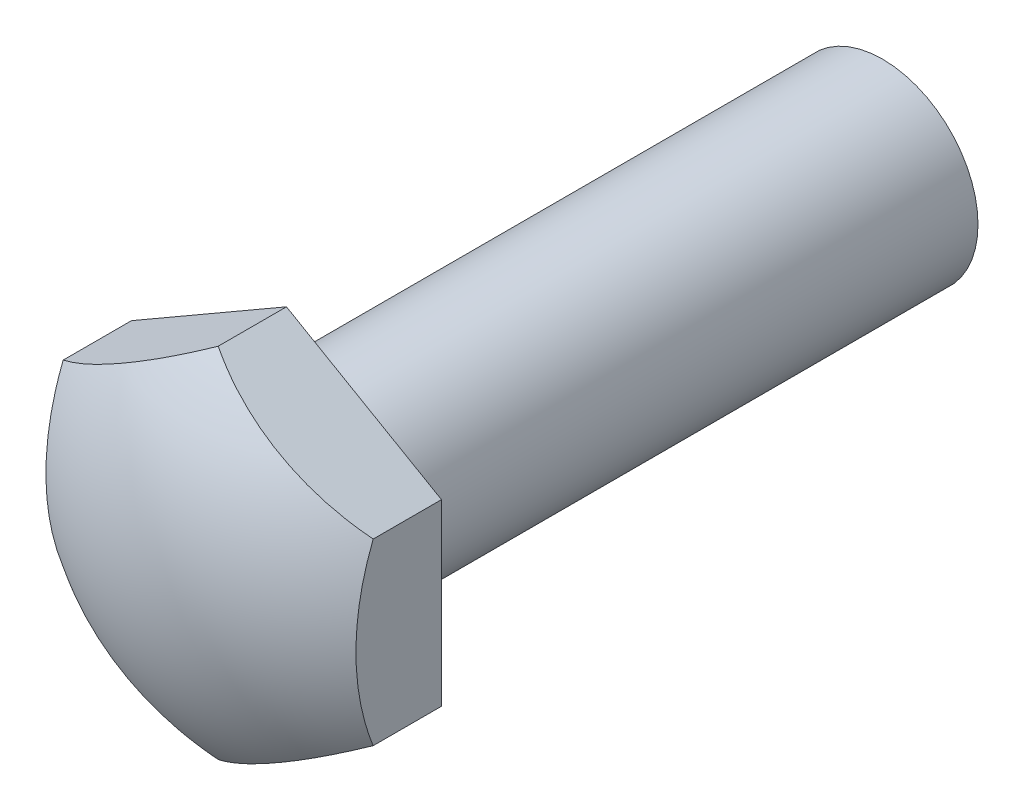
ISO-10303-21;
HEADER;
FILE_DESCRIPTION(('STEP AP214'),'2;1');
FILE_NAME('part.step','',(''),(''),'','','');
FILE_SCHEMA(('AUTOMOTIVE_DESIGN { 1 0 10303 214 1 1 1 1 }'));
ENDSEC;
DATA;
#1=APPLICATION_CONTEXT('core data for automotive mechanical design processes');
#2=APPLICATION_PROTOCOL_DEFINITION('international standard','automotive_design',2000,#1);
#3=PRODUCT_CONTEXT('',#1,'mechanical');
#4=PRODUCT('Part','Part','',(#3));
#5=PRODUCT_RELATED_PRODUCT_CATEGORY('part','',(#4));
#6=PRODUCT_DEFINITION_FORMATION('','',#4);
#7=PRODUCT_DEFINITION_CONTEXT('part definition',#1,'design');
#8=PRODUCT_DEFINITION('design','',#6,#7);
#9=PRODUCT_DEFINITION_SHAPE('','',#8);
#10=(LENGTH_UNIT() NAMED_UNIT(*) SI_UNIT(.MILLI.,.METRE.));
#11=(NAMED_UNIT(*) PLANE_ANGLE_UNIT() SI_UNIT($,.RADIAN.));
#12=(NAMED_UNIT(*) SI_UNIT($,.STERADIAN.) SOLID_ANGLE_UNIT());
#13=UNCERTAINTY_MEASURE_WITH_UNIT(LENGTH_MEASURE(1.E-05),#10,'distance_accuracy_value','');
#14=(GEOMETRIC_REPRESENTATION_CONTEXT(3) GLOBAL_UNCERTAINTY_ASSIGNED_CONTEXT((#13)) GLOBAL_UNIT_ASSIGNED_CONTEXT((#10,
#11,#12)) REPRESENTATION_CONTEXT('',''));
#15=CARTESIAN_POINT('',(0.,0.,0.));
#16=DIRECTION('',(0.,0.,1.));
#17=DIRECTION('',(1.,0.,0.));
#18=AXIS2_PLACEMENT_3D('',#15,#16,#17);
#19=CARTESIAN_POINT('',(0.,0.,-6.5));
#20=DIRECTION('',(0.,-1.,0.));
#21=DIRECTION('',(0.,0.,-1.));
#22=AXIS2_PLACEMENT_3D('',#19,#20,#21);
#23=SPHERICAL_SURFACE('',#22,12.);
#24=CARTESIAN_POINT('',(6.5,-3.75277674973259,2.86304793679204));
#25=CARTESIAN_POINT('',(6.2721551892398,-3.88432301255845,2.96853002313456));
#26=CARTESIAN_POINT('',(6.04044548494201,-4.01810067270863,3.062865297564));
#27=CARTESIAN_POINT('',(5.57097708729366,-4.28914837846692,3.22869967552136));
#28=CARTESIAN_POINT('',(5.33321843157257,-4.42641840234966,3.30019892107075));
#29=CARTESIAN_POINT('',(4.85308051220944,-4.70362615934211,3.41988222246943));
#30=CARTESIAN_POINT('',(4.61069670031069,-4.84356651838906,3.46804195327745));
#31=CARTESIAN_POINT('',(4.12328972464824,-5.12497106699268,3.54059966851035));
#32=CARTESIAN_POINT('',(3.87826670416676,-5.26643517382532,3.56499893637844));
#33=CARTESIAN_POINT('',(3.38714139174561,-5.54998650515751,3.58987311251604));
#34=CARTESIAN_POINT('',(3.14103846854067,-5.69207409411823,3.59033139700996));
#35=CARTESIAN_POINT('',(2.64967588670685,-5.97576241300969,3.56727804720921));
#36=CARTESIAN_POINT('',(2.40441622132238,-6.11736314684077,3.54376660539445));
#37=CARTESIAN_POINT('',(1.91699933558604,-6.39877341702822,3.47301868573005));
#38=CARTESIAN_POINT('',(1.67483676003,-6.53858604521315,3.42583123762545));
#39=CARTESIAN_POINT('',(1.19491039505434,-6.81567166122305,3.30810786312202));
#40=CARTESIAN_POINT('',(0.957144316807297,-6.95294597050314,3.23758446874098));
#41=CARTESIAN_POINT('',(0.600162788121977,-7.15904935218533,3.11299051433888));
#42=CARTESIAN_POINT('',(0.478729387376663,-7.22915895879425,3.06722679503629));
#43=CARTESIAN_POINT('',(0.237856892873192,-7.3682267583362,2.96965410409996));
#44=CARTESIAN_POINT('',(0.118415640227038,-7.4371861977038,2.91785223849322));
#45=CARTESIAN_POINT('',(0.,-7.50555349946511,2.86304793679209));
#46=B_SPLINE_CURVE_WITH_KNOTS('',3,(#24,#25,#26,#27,#28,#29,#30,#31,#32,#33,#34,#35,#36,#37,#38,
#39,#40,#41,#42,#43,#44,#45),.UNSPECIFIED.,.F.,.F.,(4,2,2,2,2,2,2,2,2,2,4),(0.,
0.850091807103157,1.70017832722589,2.55114893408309,3.40207357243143,4.2535890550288,
5.10509769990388,5.95485022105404,6.80414714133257,7.24651802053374,7.68837345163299),.UNSPECIFIED.);
#47=CARTESIAN_POINT('',(6.5,-3.75277674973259,2.86304793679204));
#48=VERTEX_POINT('',#47);
#49=CARTESIAN_POINT('',(0.,-7.50555349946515,2.86304793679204));
#50=VERTEX_POINT('',#49);
#51=EDGE_CURVE('E124',#48,#50,#46,.T.);
#52=ORIENTED_EDGE('',*,*,#51,.F.);
#53=CARTESIAN_POINT('',(6.5,3.75277674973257,2.86304793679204));
#54=CARTESIAN_POINT('',(6.5,3.48968422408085,2.96853002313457));
#55=CARTESIAN_POINT('',(6.5,3.2221289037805,3.06286529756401));
#56=CARTESIAN_POINT('',(6.5,2.68003349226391,3.22869967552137));
#57=CARTESIAN_POINT('',(6.5,2.40549344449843,3.30019892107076));
#58=CARTESIAN_POINT('',(6.5,1.85107793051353,3.41988222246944));
#59=CARTESIAN_POINT('',(6.5,1.57119721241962,3.46804195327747));
#60=CARTESIAN_POINT('',(6.5,1.00838811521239,3.54059966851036));
#61=CARTESIAN_POINT('',(6.5,0.725459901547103,3.56499893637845));
#62=CARTESIAN_POINT('',(6.5,0.158357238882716,3.58987311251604));
#63=CARTESIAN_POINT('',(6.5,-0.125817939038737,3.59033139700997));
#64=CARTESIAN_POINT('',(6.50000000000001,-0.693194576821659,3.56727804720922));
#65=CARTESIAN_POINT('',(6.5,-0.976396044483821,3.54376660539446));
#66=CARTESIAN_POINT('',(6.50000000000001,-1.53921658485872,3.47301868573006));
#67=CARTESIAN_POINT('',(6.50000000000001,-1.81884184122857,3.42583123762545));
#68=CARTESIAN_POINT('',(6.5,-2.37301307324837,3.30810786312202));
#69=CARTESIAN_POINT('',(6.5,-2.64756169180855,3.23758446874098));
#70=CARTESIAN_POINT('',(6.5,-3.05976845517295,3.11299051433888));
#71=CARTESIAN_POINT('',(6.50000000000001,-3.1999876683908,3.06722679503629));
#72=CARTESIAN_POINT('',(6.50000000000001,-3.47812326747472,2.96965410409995));
#73=CARTESIAN_POINT('',(6.50000000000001,-3.61604214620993,2.91785223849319));
#74=CARTESIAN_POINT('',(6.5,-3.75277674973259,2.86304793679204));
#75=B_SPLINE_CURVE_WITH_KNOTS('',3,(#53,#54,#55,#56,#57,#58,#59,#60,#61,#62,#63,#64,#65,#66,#67,
#68,#69,#70,#71,#72,#73,#74),.UNSPECIFIED.,.F.,.F.,(4,2,2,2,2,2,2,2,2,2,4),(0.,
0.850091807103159,1.70017832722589,2.5511489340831,3.40207357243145,4.25358905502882,
5.1050976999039,5.95485022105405,6.80414714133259,7.24651802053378,7.68837345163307),.UNSPECIFIED.);
#76=CARTESIAN_POINT('',(6.5,3.75277674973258,2.86304793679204));
#77=VERTEX_POINT('',#76);
#78=EDGE_CURVE('E76',#77,#48,#75,.T.);
#79=ORIENTED_EDGE('',*,*,#78,.F.);
#80=CARTESIAN_POINT('',(0.,7.50555349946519,2.86304793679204));
#81=CARTESIAN_POINT('',(0.227844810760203,7.37400723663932,2.96853002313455));
#82=CARTESIAN_POINT('',(0.459554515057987,7.24022957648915,3.06286529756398));
#83=CARTESIAN_POINT('',(0.929022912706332,6.96918187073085,3.22869967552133));
#84=CARTESIAN_POINT('',(1.16678156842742,6.83191184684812,3.30019892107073));
#85=CARTESIAN_POINT('',(1.64691948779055,6.55470408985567,3.41988222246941));
#86=CARTESIAN_POINT('',(1.88930329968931,6.41476373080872,3.46804195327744));
#87=CARTESIAN_POINT('',(2.37671027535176,6.13335918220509,3.54059966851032));
#88=CARTESIAN_POINT('',(2.62173329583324,5.99189507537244,3.56499893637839));
#89=CARTESIAN_POINT('',(3.1128586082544,5.70834374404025,3.58987311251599));
#90=CARTESIAN_POINT('',(3.35896153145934,5.56625615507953,3.59033139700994));
#91=CARTESIAN_POINT('',(3.85032411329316,5.28256783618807,3.5672780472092));
#92=CARTESIAN_POINT('',(4.09558377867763,5.14096710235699,3.54376660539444));
#93=CARTESIAN_POINT('',(4.58300066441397,4.85955683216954,3.47301868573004));
#94=CARTESIAN_POINT('',(4.82516323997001,4.71974420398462,3.42583123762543));
#95=CARTESIAN_POINT('',(5.30508960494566,4.44265858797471,3.30810786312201));
#96=CARTESIAN_POINT('',(5.5428556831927,4.3053842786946,3.23758446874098));
#97=CARTESIAN_POINT('',(5.89983721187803,4.09928089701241,3.11299051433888));
#98=CARTESIAN_POINT('',(6.02127061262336,4.0291712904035,3.06722679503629));
#99=CARTESIAN_POINT('',(6.26214310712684,3.89010349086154,2.96965410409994));
#100=CARTESIAN_POINT('',(6.38158435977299,3.82114405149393,2.91785223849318));
#101=CARTESIAN_POINT('',(6.5,3.75277674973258,2.86304793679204));
#102=B_SPLINE_CURVE_WITH_KNOTS('',3,(#80,#81,#82,#83,#84,#85,#86,#87,#88,#89,#90,#91,#92,#93,
#94,#95,#96,#97,#98,#99,#100,#101),.UNSPECIFIED.,.F.,.F.,(4,2,2,2,2,2,2,2,2,2,4),(0.,
0.850091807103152,1.70017832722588,2.55114893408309,3.40207357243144,4.25358905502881,
5.10509769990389,5.95485022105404,6.80414714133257,7.24651802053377,7.68837345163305),.UNSPECIFIED.);
#103=CARTESIAN_POINT('',(0.,7.50555349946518,2.86304793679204));
#104=VERTEX_POINT('',#103);
#105=EDGE_CURVE('E18',#104,#77,#102,.T.);
#106=ORIENTED_EDGE('',*,*,#105,.F.);
#107=CARTESIAN_POINT('',(-6.5,3.75277674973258,2.86304793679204));
#108=CARTESIAN_POINT('',(-6.2721551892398,3.88432301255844,2.96853002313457));
#109=CARTESIAN_POINT('',(-6.04044548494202,4.01810067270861,3.062865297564));
#110=CARTESIAN_POINT('',(-5.57097708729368,4.28914837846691,3.22869967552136));
#111=CARTESIAN_POINT('',(-5.33321843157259,4.42641840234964,3.30019892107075));
#112=CARTESIAN_POINT('',(-4.85308051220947,4.70362615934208,3.41988222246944));
#113=CARTESIAN_POINT('',(-4.61069670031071,4.84356651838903,3.46804195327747));
#114=CARTESIAN_POINT('',(-4.12328972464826,5.12497106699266,3.54059966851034));
#115=CARTESIAN_POINT('',(-3.87826670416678,5.26643517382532,3.5649989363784));
#116=CARTESIAN_POINT('',(-3.38714139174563,5.54998650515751,3.58987311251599));
#117=CARTESIAN_POINT('',(-3.14103846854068,5.69207409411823,3.59033139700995));
#118=CARTESIAN_POINT('',(-2.64967588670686,5.97576241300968,3.56727804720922));
#119=CARTESIAN_POINT('',(-2.40441622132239,6.11736314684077,3.54376660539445));
#120=CARTESIAN_POINT('',(-1.91699933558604,6.39877341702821,3.47301868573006));
#121=CARTESIAN_POINT('',(-1.67483676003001,6.53858604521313,3.42583123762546));
#122=CARTESIAN_POINT('',(-1.19491039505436,6.81567166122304,3.30810786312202));
#123=CARTESIAN_POINT('',(-0.957144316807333,6.95294597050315,3.23758446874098));
#124=CARTESIAN_POINT('',(-0.600162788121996,7.15904935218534,3.11299051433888));
#125=CARTESIAN_POINT('',(-0.478729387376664,7.22915895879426,3.06722679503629));
#126=CARTESIAN_POINT('',(-0.237856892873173,7.36822675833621,2.96965410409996));
#127=CARTESIAN_POINT('',(-0.118415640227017,7.43718619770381,2.9178522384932));
#128=CARTESIAN_POINT('',(0.,7.50555349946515,2.86304793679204));
#129=B_SPLINE_CURVE_WITH_KNOTS('',3,(#107,#108,#109,#110,#111,#112,#113,#114,#115,#116,#117,
#118,#119,#120,#121,#122,#123,#124,#125,#126,#127,#128),.UNSPECIFIED.,.F.,.F.,(4,2,2,2,2,2,2,2,
2,2,4),(0.,0.85009180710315,1.70017832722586,2.55114893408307,3.40207357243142,4.25358905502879,
5.10509769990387,5.95485022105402,6.80414714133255,7.24651802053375,7.68837345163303),.UNSPECIFIED.);
#130=CARTESIAN_POINT('',(-6.5,3.75277674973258,2.86304793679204));
#131=VERTEX_POINT('',#130);
#132=EDGE_CURVE('E73',#131,#104,#129,.T.);
#133=ORIENTED_EDGE('',*,*,#132,.F.);
#134=CARTESIAN_POINT('',(-6.5,-3.75277674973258,2.86304793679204));
#135=CARTESIAN_POINT('',(-6.5,-3.48968422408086,2.96853002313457));
#136=CARTESIAN_POINT('',(-6.5,-3.2221289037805,3.06286529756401));
#137=CARTESIAN_POINT('',(-6.5,-2.68003349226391,3.22869967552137));
#138=CARTESIAN_POINT('',(-6.5,-2.40549344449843,3.30019892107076));
#139=CARTESIAN_POINT('',(-6.50000000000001,-1.85107793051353,3.41988222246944));
#140=CARTESIAN_POINT('',(-6.50000000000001,-1.57119721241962,3.46804195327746));
#141=CARTESIAN_POINT('',(-6.5,-1.00838811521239,3.54059966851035));
#142=CARTESIAN_POINT('',(-6.5,-0.725459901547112,3.56499893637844));
#143=CARTESIAN_POINT('',(-6.5,-0.158357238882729,3.58987311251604));
#144=CARTESIAN_POINT('',(-6.50000000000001,0.125817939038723,3.59033139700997));
#145=CARTESIAN_POINT('',(-6.50000000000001,0.693194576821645,3.56727804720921));
#146=CARTESIAN_POINT('',(-6.50000000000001,0.976396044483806,3.54376660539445));
#147=CARTESIAN_POINT('',(-6.50000000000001,1.53921658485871,3.47301868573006));
#148=CARTESIAN_POINT('',(-6.50000000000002,1.81884184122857,3.42583123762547));
#149=CARTESIAN_POINT('',(-6.50000000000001,2.37301307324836,3.308107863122));
#150=CARTESIAN_POINT('',(-6.49999999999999,2.64756169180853,3.23758446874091));
#151=CARTESIAN_POINT('',(-6.5,3.05976845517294,3.11299051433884));
#152=CARTESIAN_POINT('',(-6.50000000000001,3.19998766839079,3.06722679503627));
#153=CARTESIAN_POINT('',(-6.50000000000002,3.47812326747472,2.96965410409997));
#154=CARTESIAN_POINT('',(-6.50000000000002,3.61604214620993,2.91785223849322));
#155=CARTESIAN_POINT('',(-6.5,3.75277674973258,2.86304793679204));
#156=B_SPLINE_CURVE_WITH_KNOTS('',3,(#134,#135,#136,#137,#138,#139,#140,#141,#142,#143,#144,
#145,#146,#147,#148,#149,#150,#151,#152,#153,#154,#155),.UNSPECIFIED.,.F.,.F.,(4,2,2,2,2,2,2,2,
2,2,4),(0.,0.850091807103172,1.70017832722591,2.55114893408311,3.40207357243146,
4.25358905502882,5.1050976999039,5.95485022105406,6.8041471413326,7.24651802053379,
7.68837345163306),.UNSPECIFIED.);
#157=CARTESIAN_POINT('',(-6.5,-3.75277674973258,2.86304793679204));
#158=VERTEX_POINT('',#157);
#159=EDGE_CURVE('E87',#158,#131,#156,.T.);
#160=ORIENTED_EDGE('',*,*,#159,.F.);
#161=CARTESIAN_POINT('',(0.,-7.50555349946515,2.86304793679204));
#162=CARTESIAN_POINT('',(-0.227844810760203,-7.37400723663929,2.96853002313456));
#163=CARTESIAN_POINT('',(-0.459554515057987,-7.24022957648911,3.062865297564));
#164=CARTESIAN_POINT('',(-0.929022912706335,-6.96918187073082,3.22869967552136));
#165=CARTESIAN_POINT('',(-1.16678156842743,-6.83191184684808,3.30019892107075));
#166=CARTESIAN_POINT('',(-1.64691948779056,-6.55470408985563,3.41988222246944));
#167=CARTESIAN_POINT('',(-1.88930329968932,-6.41476373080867,3.46804195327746));
#168=CARTESIAN_POINT('',(-2.37671027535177,-6.13335918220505,3.54059966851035));
#169=CARTESIAN_POINT('',(-2.62173329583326,-5.99189507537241,3.56499893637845));
#170=CARTESIAN_POINT('',(-3.11285860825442,-5.70834374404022,3.58987311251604));
#171=CARTESIAN_POINT('',(-3.35896153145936,-5.56625615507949,3.59033139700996));
#172=CARTESIAN_POINT('',(-3.85032411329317,-5.28256783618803,3.56727804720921));
#173=CARTESIAN_POINT('',(-4.09558377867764,-5.14096710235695,3.54376660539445));
#174=CARTESIAN_POINT('',(-4.58300066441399,-4.8595568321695,3.47301868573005));
#175=CARTESIAN_POINT('',(-4.82516323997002,-4.71974420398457,3.42583123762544));
#176=CARTESIAN_POINT('',(-5.30508960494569,-4.44265858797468,3.30810786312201));
#177=CARTESIAN_POINT('',(-5.54285568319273,-4.30538427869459,3.23758446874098));
#178=CARTESIAN_POINT('',(-5.89983721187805,-4.09928089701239,3.11299051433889));
#179=CARTESIAN_POINT('',(-6.02127061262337,-4.02917129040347,3.06722679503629));
#180=CARTESIAN_POINT('',(-6.26214310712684,-3.89010349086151,2.96965410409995));
#181=CARTESIAN_POINT('',(-6.38158435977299,-3.82114405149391,2.91785223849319));
#182=CARTESIAN_POINT('',(-6.5,-3.75277674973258,2.86304793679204));
#183=B_SPLINE_CURVE_WITH_KNOTS('',3,(#161,#162,#163,#164,#165,#166,#167,#168,#169,#170,#171,
#172,#173,#174,#175,#176,#177,#178,#179,#180,#181,#182),.UNSPECIFIED.,.F.,.F.,(4,2,2,2,2,2,2,2,
2,2,4),(0.,0.850091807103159,1.70017832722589,2.55114893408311,3.40207357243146,
4.25358905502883,5.10509769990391,5.95485022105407,6.8041471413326,7.24651802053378,
7.68837345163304),.UNSPECIFIED.);
#184=EDGE_CURVE('E118',#50,#158,#183,.T.);
#185=ORIENTED_EDGE('',*,*,#184,.F.);
#186=EDGE_LOOP('',(#52,#79,#106,#133,#160,#185));
#187=FACE_BOUND('',#186,.T.);
#188=ADVANCED_FACE('F14',(#187),#23,.T.);
#189=CARTESIAN_POINT('',(0.,7.50555349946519,8.));
#190=DIRECTION('',(0.5,0.866025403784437,0.));
#191=DIRECTION('',(-0.866025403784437,0.5,0.));
#192=AXIS2_PLACEMENT_3D('',#189,#190,#191);
#193=PLANE('',#192);
#194=DIRECTION('',(-0.866025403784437,0.5,0.));
#195=VECTOR('',#194,1.);
#196=CARTESIAN_POINT('',(6.5,3.75277674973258,0.));
#197=LINE('',#196,#195);
#198=CARTESIAN_POINT('',(6.5,3.75277674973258,0.));
#199=VERTEX_POINT('',#198);
#200=CARTESIAN_POINT('',(0.,7.50555349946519,0.));
#201=VERTEX_POINT('',#200);
#202=EDGE_CURVE('E84',#199,#201,#197,.T.);
#203=ORIENTED_EDGE('',*,*,#202,.T.);
#204=DIRECTION('',(0.,0.,1.));
#205=VECTOR('',#204,1.);
#206=CARTESIAN_POINT('',(0.,7.50555349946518,8.));
#207=LINE('',#206,#205);
#208=EDGE_CURVE('E81',#104,#201,#207,.F.);
#209=ORIENTED_EDGE('',*,*,#208,.F.);
#210=ORIENTED_EDGE('',*,*,#105,.T.);
#211=DIRECTION('',(0.,0.,1.));
#212=VECTOR('',#211,1.);
#213=CARTESIAN_POINT('',(6.5,3.75277674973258,8.));
#214=LINE('',#213,#212);
#215=EDGE_CURVE('E131',#199,#77,#214,.T.);
#216=ORIENTED_EDGE('',*,*,#215,.F.);
#217=EDGE_LOOP('',(#203,#209,#210,#216));
#218=FACE_BOUND('',#217,.T.);
#219=ADVANCED_FACE('F82',(#218),#193,.T.);
#220=CARTESIAN_POINT('',(-6.5,3.75277674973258,8.));
#221=DIRECTION('',(-0.5,0.866025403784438,0.));
#222=DIRECTION('',(-0.866025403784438,-0.5,0.));
#223=AXIS2_PLACEMENT_3D('',#220,#221,#222);
#224=PLANE('',#223);
#225=DIRECTION('',(-0.866025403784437,-0.5,0.));
#226=VECTOR('',#225,1.);
#227=CARTESIAN_POINT('',(0.,7.50555349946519,0.));
#228=LINE('',#227,#226);
#229=CARTESIAN_POINT('',(-6.5,3.75277674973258,0.));
#230=VERTEX_POINT('',#229);
#231=EDGE_CURVE('E145',#201,#230,#228,.T.);
#232=ORIENTED_EDGE('',*,*,#231,.T.);
#233=DIRECTION('',(0.,0.,1.));
#234=VECTOR('',#233,1.);
#235=CARTESIAN_POINT('',(-6.5,3.75277674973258,8.));
#236=LINE('',#235,#234);
#237=EDGE_CURVE('E91',#131,#230,#236,.F.);
#238=ORIENTED_EDGE('',*,*,#237,.F.);
#239=ORIENTED_EDGE('',*,*,#132,.T.);
#240=ORIENTED_EDGE('',*,*,#208,.T.);
#241=EDGE_LOOP('',(#232,#238,#239,#240));
#242=FACE_BOUND('',#241,.T.);
#243=ADVANCED_FACE('F89',(#242),#224,.T.);
#244=CARTESIAN_POINT('',(-6.5,-3.75277674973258,8.));
#245=DIRECTION('',(-1.,0.,0.));
#246=DIRECTION('',(0.,-1.,0.));
#247=AXIS2_PLACEMENT_3D('',#244,#245,#246);
#248=PLANE('',#247);
#249=DIRECTION('',(0.,-1.,0.));
#250=VECTOR('',#249,1.);
#251=CARTESIAN_POINT('',(-6.5,0.,0.));
#252=LINE('',#251,#250);
#253=CARTESIAN_POINT('',(-6.5,-3.75277674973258,0.));
#254=VERTEX_POINT('',#253);
#255=EDGE_CURVE('E153',#230,#254,#252,.T.);
#256=ORIENTED_EDGE('',*,*,#255,.T.);
#257=DIRECTION('',(0.,0.,1.));
#258=VECTOR('',#257,1.);
#259=CARTESIAN_POINT('',(-6.5,-3.75277674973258,8.));
#260=LINE('',#259,#258);
#261=EDGE_CURVE('E121',#158,#254,#260,.F.);
#262=ORIENTED_EDGE('',*,*,#261,.F.);
#263=ORIENTED_EDGE('',*,*,#159,.T.);
#264=ORIENTED_EDGE('',*,*,#237,.T.);
#265=EDGE_LOOP('',(#256,#262,#263,#264));
#266=FACE_BOUND('',#265,.T.);
#267=ADVANCED_FACE('F206',(#266),#248,.T.);
#268=CARTESIAN_POINT('',(0.,-7.50555349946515,8.));
#269=DIRECTION('',(-0.5,-0.86602540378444,0.));
#270=DIRECTION('',(0.86602540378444,-0.5,0.));
#271=AXIS2_PLACEMENT_3D('',#268,#269,#270);
#272=PLANE('',#271);
#273=DIRECTION('',(0.86602540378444,-0.5,0.));
#274=VECTOR('',#273,1.);
#275=CARTESIAN_POINT('',(-6.5,-3.75277674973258,0.));
#276=LINE('',#275,#274);
#277=CARTESIAN_POINT('',(0.,-7.50555349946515,0.));
#278=VERTEX_POINT('',#277);
#279=EDGE_CURVE('E149',#254,#278,#276,.T.);
#280=ORIENTED_EDGE('',*,*,#279,.T.);
#281=DIRECTION('',(0.,0.,1.));
#282=VECTOR('',#281,1.);
#283=CARTESIAN_POINT('',(0.,-7.50555349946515,8.));
#284=LINE('',#283,#282);
#285=EDGE_CURVE('E127',#50,#278,#284,.F.);
#286=ORIENTED_EDGE('',*,*,#285,.F.);
#287=ORIENTED_EDGE('',*,*,#184,.T.);
#288=ORIENTED_EDGE('',*,*,#261,.T.);
#289=EDGE_LOOP('',(#280,#286,#287,#288));
#290=FACE_BOUND('',#289,.T.);
#291=ADVANCED_FACE('F204',(#290),#272,.T.);
#292=CARTESIAN_POINT('',(6.5,-3.75277674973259,8.));
#293=DIRECTION('',(0.5,-0.86602540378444,0.));
#294=DIRECTION('',(0.86602540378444,0.5,0.));
#295=AXIS2_PLACEMENT_3D('',#292,#293,#294);
#296=PLANE('',#295);
#297=DIRECTION('',(0.86602540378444,0.5,0.));
#298=VECTOR('',#297,1.);
#299=CARTESIAN_POINT('',(0.,-7.50555349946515,0.));
#300=LINE('',#299,#298);
#301=CARTESIAN_POINT('',(6.5,-3.75277674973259,0.));
#302=VERTEX_POINT('',#301);
#303=EDGE_CURVE('E39',#278,#302,#300,.T.);
#304=ORIENTED_EDGE('',*,*,#303,.T.);
#305=DIRECTION('',(0.,0.,1.));
#306=VECTOR('',#305,1.);
#307=CARTESIAN_POINT('',(6.5,-3.7527767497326,8.));
#308=LINE('',#307,#306);
#309=EDGE_CURVE('E133',#48,#302,#308,.F.);
#310=ORIENTED_EDGE('',*,*,#309,.F.);
#311=ORIENTED_EDGE('',*,*,#51,.T.);
#312=ORIENTED_EDGE('',*,*,#285,.T.);
#313=EDGE_LOOP('',(#304,#310,#311,#312));
#314=FACE_BOUND('',#313,.T.);
#315=ADVANCED_FACE('F179',(#314),#296,.T.);
#316=CARTESIAN_POINT('',(6.5,3.75277674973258,8.));
#317=DIRECTION('',(1.,0.,0.));
#318=DIRECTION('',(0.,1.,0.));
#319=AXIS2_PLACEMENT_3D('',#316,#317,#318);
#320=PLANE('',#319);
#321=DIRECTION('',(0.,-1.,0.));
#322=VECTOR('',#321,1.);
#323=CARTESIAN_POINT('',(6.5,0.,0.));
#324=LINE('',#323,#322);
#325=EDGE_CURVE('E139',#302,#199,#324,.F.);
#326=ORIENTED_EDGE('',*,*,#325,.T.);
#327=ORIENTED_EDGE('',*,*,#215,.T.);
#328=ORIENTED_EDGE('',*,*,#78,.T.);
#329=ORIENTED_EDGE('',*,*,#309,.T.);
#330=EDGE_LOOP('',(#326,#327,#328,#329));
#331=FACE_BOUND('',#330,.T.);
#332=ADVANCED_FACE('F174',(#331),#320,.T.);
#333=CARTESIAN_POINT('',(0.,0.,-25.));
#334=DIRECTION('',(0.,0.,-1.));
#335=DIRECTION('',(0.,1.,0.));
#336=AXIS2_PLACEMENT_3D('',#333,#334,#335);
#337=PLANE('',#336);
#338=CARTESIAN_POINT('',(0.,0.,-25.));
#339=DIRECTION('',(0.,0.,1.));
#340=DIRECTION('',(0.,-1.,0.));
#341=AXIS2_PLACEMENT_3D('',#338,#339,#340);
#342=CIRCLE('',#341,4.);
#343=CARTESIAN_POINT('',(0.,-4.,-25.));
#344=VERTEX_POINT('',#343);
#345=EDGE_CURVE('E30',#344,#344,#342,.T.);
#346=ORIENTED_EDGE('',*,*,#345,.F.);
#347=EDGE_LOOP('',(#346));
#348=FACE_BOUND('',#347,.T.);
#349=ADVANCED_FACE('F178',(#348),#337,.T.);
#350=CARTESIAN_POINT('',(5.,0.,0.));
#351=DIRECTION('',(0.,0.,1.));
#352=DIRECTION('',(0.,-1.,0.));
#353=AXIS2_PLACEMENT_3D('',#350,#351,#352);
#354=PLANE('',#353);
#355=CARTESIAN_POINT('',(0.,0.,0.));
#356=DIRECTION('',(0.,0.,1.));
#357=DIRECTION('',(0.,-1.,0.));
#358=AXIS2_PLACEMENT_3D('',#355,#356,#357);
#359=CIRCLE('',#358,4.);
#360=CARTESIAN_POINT('',(0.,-4.,0.));
#361=VERTEX_POINT('',#360);
#362=EDGE_CURVE('E9',#361,#361,#359,.F.);
#363=ORIENTED_EDGE('',*,*,#362,.F.);
#364=EDGE_LOOP('',(#363));
#365=FACE_BOUND('',#364,.T.);
#366=ORIENTED_EDGE('',*,*,#303,.F.);
#367=ORIENTED_EDGE('',*,*,#279,.F.);
#368=ORIENTED_EDGE('',*,*,#255,.F.);
#369=ORIENTED_EDGE('',*,*,#231,.F.);
#370=ORIENTED_EDGE('',*,*,#202,.F.);
#371=ORIENTED_EDGE('',*,*,#325,.F.);
#372=EDGE_LOOP('',(#366,#367,#368,#369,#370,#371));
#373=FACE_BOUND('',#372,.T.);
#374=ADVANCED_FACE('F184',(#365,#373),#354,.F.);
#375=CARTESIAN_POINT('',(0.,0.,-40.));
#376=DIRECTION('',(0.,0.,1.));
#377=DIRECTION('',(0.,-1.,0.));
#378=AXIS2_PLACEMENT_3D('',#375,#376,#377);
#379=CYLINDRICAL_SURFACE('',#378,4.);
#380=ORIENTED_EDGE('',*,*,#345,.T.);
#381=EDGE_LOOP('',(#380));
#382=FACE_BOUND('',#381,.T.);
#383=ORIENTED_EDGE('',*,*,#362,.T.);
#384=EDGE_LOOP('',(#383));
#385=FACE_BOUND('',#384,.T.);
#386=ADVANCED_FACE('F16',(#382,#385),#379,.T.);
#387=CLOSED_SHELL('',(#188,#219,#243,#267,#291,#315,#332,#349,#374,#386));
#388=MANIFOLD_SOLID_BREP('B1',#387);
#389=ADVANCED_BREP_SHAPE_REPRESENTATION('',(#18,#388),#14);
#390=SHAPE_DEFINITION_REPRESENTATION(#9,#389);
ENDSEC;
END-ISO-10303-21;
